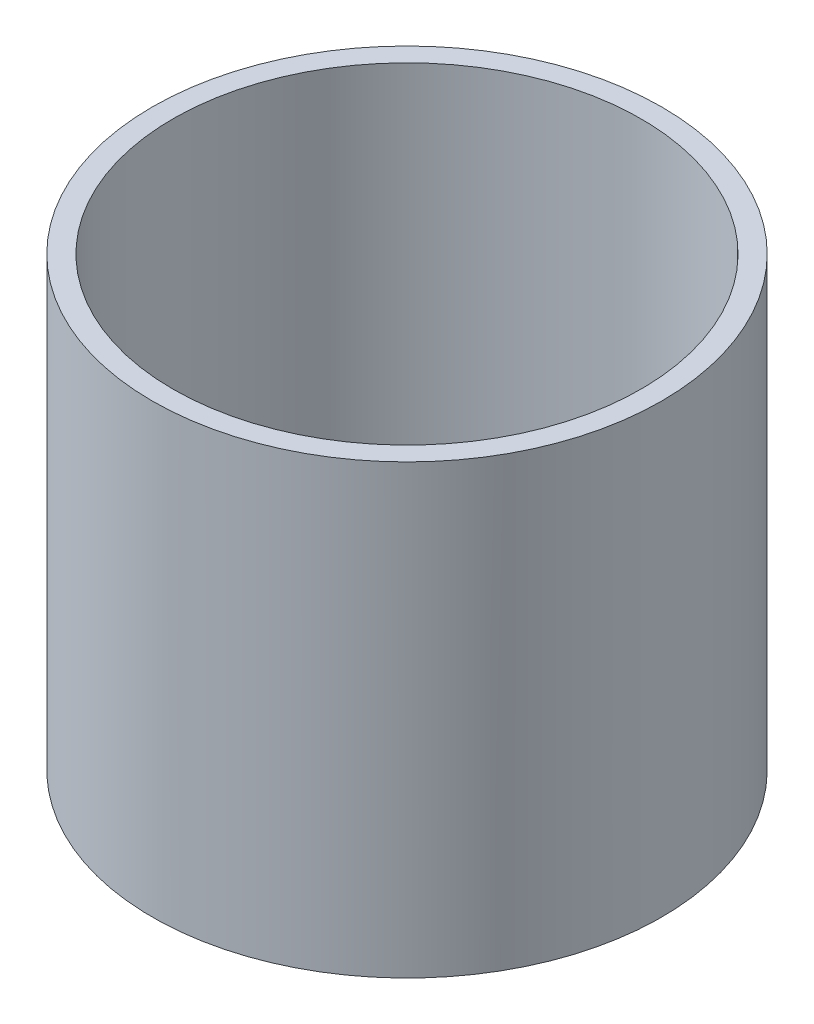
from build123d import *

# Parameters (mm, degrees)
SKETCH1_R           = 5.1816
BOSS_EXTRUDE1_DEPTH = 7.8232
SKETCH2_R           = 4.7625
CUT_EXTRUDE1_DEPTH  = 6.985
SKETCH3_R           = 4.0259
CUT_EXTRUDE2_DEPTH  = 0.508
BOSS_EXTRUDE2_START = 1.27
SKETCH5_R           = 5.1816
BOSS_EXTRUDE2_DEPTH = 1.27
SKETCH6_R           = 4.0259
CUT_EXTRUDE3_DEPTH  = 1.27


with BuildPart() as part:
    # Sketch1 → Boss-Extrude1 (new body)
    with BuildSketch(Plane(origin=(0, 0, 0), x_dir=(1, 0, 0), z_dir=(0, 1, 0))):
        with Locations(Location((0, 0, 0), (0, 0, 270))):
            Circle(SKETCH1_R)
    extrude(amount=BOSS_EXTRUDE1_DEPTH)

    # Sketch2 → Cut-Extrude1 (cut)
    with BuildSketch(Plane(origin=(0, 7.8232, 0), x_dir=(-1, 0, 0), z_dir=(0, 1, 0))):
        with Locations(Location((0, 0, 0), (0, 0, 90))):
            Circle(SKETCH2_R)
    extrude(amount=-CUT_EXTRUDE1_DEPTH, mode=Mode.SUBTRACT)

    # Sketch3 → Cut-Extrude2 (cut)
    with BuildSketch(Plane.XZ):
        with Locations(Location((0, 0, 0), (0, 0, 270))):
            Circle(SKETCH3_R)
    extrude(amount=-CUT_EXTRUDE2_DEPTH, mode=Mode.SUBTRACT)

    # Sketch5 → Boss-Extrude2 (add)
    with BuildSketch(Plane.XZ.offset(BOSS_EXTRUDE2_START)):
        with Locations(Location((0, 0, 0), (0, 0, 270))):
            Circle(SKETCH5_R)
    extrude(amount=-BOSS_EXTRUDE2_DEPTH)

    # Sketch6 → Cut-Extrude3 (cut)
    with BuildSketch(Plane.XZ.offset(1.27)):
        with Locations(Location((0, 0, 0), (0, 0, 270))):
            Circle(SKETCH6_R)
    extrude(amount=-CUT_EXTRUDE3_DEPTH, mode=Mode.SUBTRACT)


solid = part.part
